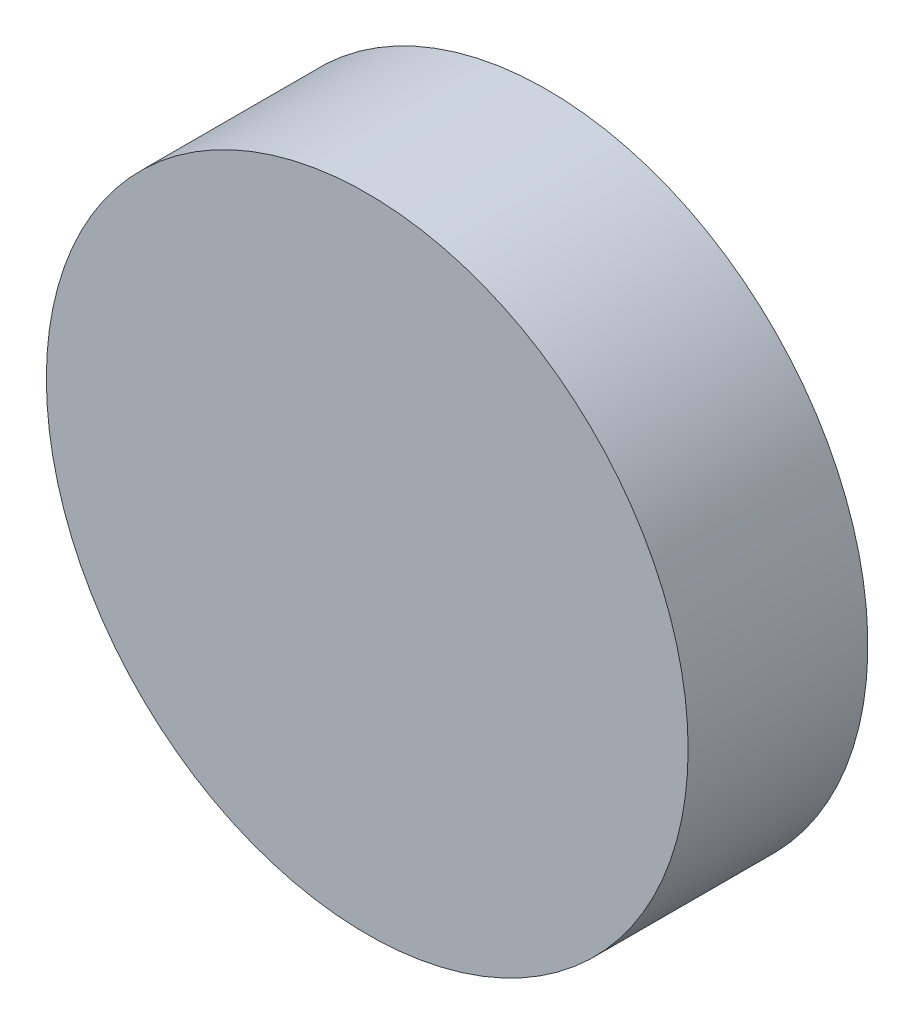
ISO-10303-21;
HEADER;
FILE_DESCRIPTION(('STEP AP214'),'2;1');
FILE_NAME('part.step','',(''),(''),'','','');
FILE_SCHEMA(('AUTOMOTIVE_DESIGN { 1 0 10303 214 1 1 1 1 }'));
ENDSEC;
DATA;
#1=APPLICATION_CONTEXT('core data for automotive mechanical design processes');
#2=APPLICATION_PROTOCOL_DEFINITION('international standard','automotive_design',2000,#1);
#3=PRODUCT_CONTEXT('',#1,'mechanical');
#4=PRODUCT('Part','Part','',(#3));
#5=PRODUCT_RELATED_PRODUCT_CATEGORY('part','',(#4));
#6=PRODUCT_DEFINITION_FORMATION('','',#4);
#7=PRODUCT_DEFINITION_CONTEXT('part definition',#1,'design');
#8=PRODUCT_DEFINITION('design','',#6,#7);
#9=PRODUCT_DEFINITION_SHAPE('','',#8);
#10=(LENGTH_UNIT() NAMED_UNIT(*) SI_UNIT(.MILLI.,.METRE.));
#11=(NAMED_UNIT(*) PLANE_ANGLE_UNIT() SI_UNIT($,.RADIAN.));
#12=(NAMED_UNIT(*) SI_UNIT($,.STERADIAN.) SOLID_ANGLE_UNIT());
#13=UNCERTAINTY_MEASURE_WITH_UNIT(LENGTH_MEASURE(1.E-05),#10,'distance_accuracy_value','');
#14=(GEOMETRIC_REPRESENTATION_CONTEXT(3) GLOBAL_UNCERTAINTY_ASSIGNED_CONTEXT((#13)) GLOBAL_UNIT_ASSIGNED_CONTEXT((#10,
#11,#12)) REPRESENTATION_CONTEXT('',''));
#15=CARTESIAN_POINT('',(0.,0.,0.));
#16=DIRECTION('',(0.,0.,1.));
#17=DIRECTION('',(1.,0.,0.));
#18=AXIS2_PLACEMENT_3D('',#15,#16,#17);
#19=CARTESIAN_POINT('',(0.,0.,22.5));
#20=DIRECTION('',(0.,0.,-1.));
#21=DIRECTION('',(-1.,0.,0.));
#22=AXIS2_PLACEMENT_3D('',#19,#20,#21);
#23=CYLINDRICAL_SURFACE('',#22,12.5);
#24=CARTESIAN_POINT('',(0.,0.,7.5));
#25=DIRECTION('',(0.,0.,1.));
#26=DIRECTION('',(1.,0.,0.));
#27=AXIS2_PLACEMENT_3D('',#24,#25,#26);
#28=CIRCLE('',#27,12.5);
#29=CARTESIAN_POINT('',(12.5,0.,7.5));
#30=VERTEX_POINT('',#29);
#31=EDGE_CURVE('E11',#30,#30,#28,.T.);
#32=ORIENTED_EDGE('',*,*,#31,.F.);
#33=EDGE_LOOP('',(#32));
#34=FACE_BOUND('',#33,.T.);
#35=CARTESIAN_POINT('',(0.,0.,0.5));
#36=DIRECTION('',(0.,0.,-1.));
#37=DIRECTION('',(-1.,0.,0.));
#38=AXIS2_PLACEMENT_3D('',#35,#36,#37);
#39=CIRCLE('',#38,12.5);
#40=CARTESIAN_POINT('',(-12.5,0.,0.5));
#41=VERTEX_POINT('',#40);
#42=EDGE_CURVE('E41',#41,#41,#39,.F.);
#43=ORIENTED_EDGE('',*,*,#42,.T.);
#44=EDGE_LOOP('',(#43));
#45=FACE_BOUND('',#44,.T.);
#46=ADVANCED_FACE('F37',(#34,#45),#23,.T.);
#47=CARTESIAN_POINT('',(-14.3704,-14.3704,7.5));
#48=DIRECTION('',(0.,0.,1.));
#49=DIRECTION('',(1.,0.,0.));
#50=AXIS2_PLACEMENT_3D('',#47,#48,#49);
#51=PLANE('',#50);
#52=ORIENTED_EDGE('',*,*,#31,.T.);
#53=EDGE_LOOP('',(#52));
#54=FACE_BOUND('',#53,.T.);
#55=ADVANCED_FACE('F39',(#54),#51,.T.);
#56=CARTESIAN_POINT('',(42.9329477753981,-27.7415448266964,0.5));
#57=DIRECTION('',(0.,0.,-1.));
#58=DIRECTION('',(-1.,0.,0.));
#59=AXIS2_PLACEMENT_3D('',#56,#57,#58);
#60=PLANE('',#59);
#61=ORIENTED_EDGE('',*,*,#42,.F.);
#62=EDGE_LOOP('',(#61));
#63=FACE_BOUND('',#62,.T.);
#64=ADVANCED_FACE('F51',(#63),#60,.T.);
#65=CLOSED_SHELL('',(#46,#55,#64));
#66=MANIFOLD_SOLID_BREP('B2',#65);
#67=ADVANCED_BREP_SHAPE_REPRESENTATION('',(#18,#66),#14);
#68=SHAPE_DEFINITION_REPRESENTATION(#9,#67);
ENDSEC;
END-ISO-10303-21;
